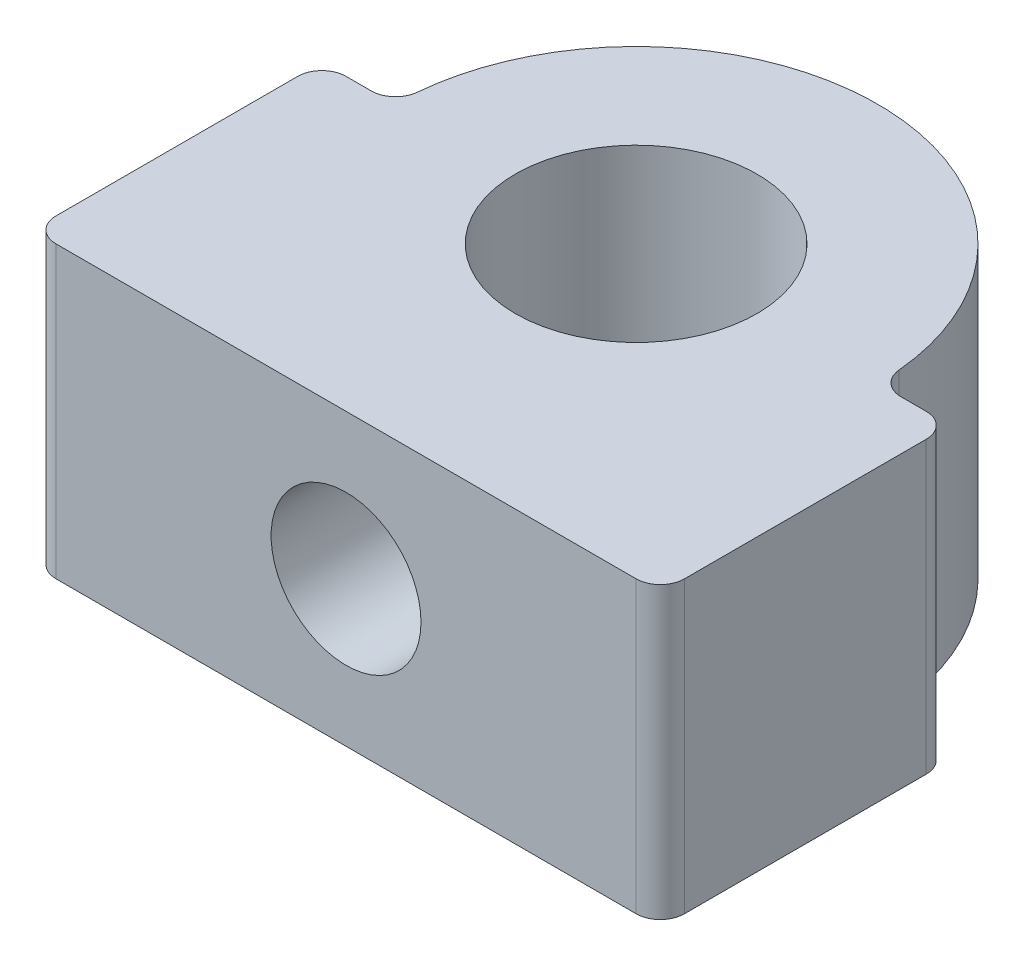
ISO-10303-21;
HEADER;
FILE_DESCRIPTION(('STEP AP214'),'2;1');
FILE_NAME('part.step','',(''),(''),'','','');
FILE_SCHEMA(('AUTOMOTIVE_DESIGN { 1 0 10303 214 1 1 1 1 }'));
ENDSEC;
DATA;
#1=APPLICATION_CONTEXT('core data for automotive mechanical design processes');
#2=APPLICATION_PROTOCOL_DEFINITION('international standard','automotive_design',2000,#1);
#3=PRODUCT_CONTEXT('',#1,'mechanical');
#4=PRODUCT('Part','Part','',(#3));
#5=PRODUCT_RELATED_PRODUCT_CATEGORY('part','',(#4));
#6=PRODUCT_DEFINITION_FORMATION('','',#4);
#7=PRODUCT_DEFINITION_CONTEXT('part definition',#1,'design');
#8=PRODUCT_DEFINITION('design','',#6,#7);
#9=PRODUCT_DEFINITION_SHAPE('','',#8);
#10=(LENGTH_UNIT() NAMED_UNIT(*) SI_UNIT(.MILLI.,.METRE.));
#11=(NAMED_UNIT(*) PLANE_ANGLE_UNIT() SI_UNIT($,.RADIAN.));
#12=(NAMED_UNIT(*) SI_UNIT($,.STERADIAN.) SOLID_ANGLE_UNIT());
#13=UNCERTAINTY_MEASURE_WITH_UNIT(LENGTH_MEASURE(1.E-05),#10,'distance_accuracy_value','');
#14=(GEOMETRIC_REPRESENTATION_CONTEXT(3) GLOBAL_UNCERTAINTY_ASSIGNED_CONTEXT((#13)) GLOBAL_UNIT_ASSIGNED_CONTEXT((#10,
#11,#12)) REPRESENTATION_CONTEXT('',''));
#15=CARTESIAN_POINT('',(0.,0.,0.));
#16=DIRECTION('',(0.,0.,1.));
#17=DIRECTION('',(1.,0.,0.));
#18=AXIS2_PLACEMENT_3D('',#15,#16,#17);
#19=CARTESIAN_POINT('',(-6.,6.,5.5));
#20=DIRECTION('',(0.,-1.,0.));
#21=DIRECTION('',(0.,0.,-1.));
#22=AXIS2_PLACEMENT_3D('',#19,#20,#21);
#23=CYLINDRICAL_SURFACE('',#22,0.5);
#24=CARTESIAN_POINT('',(-6.,0.,5.5));
#25=DIRECTION('',(0.,1.,0.));
#26=DIRECTION('',(0.,0.,1.));
#27=AXIS2_PLACEMENT_3D('',#24,#25,#26);
#28=CIRCLE('',#27,0.5);
#29=CARTESIAN_POINT('',(-6.5,0.,5.5));
#30=VERTEX_POINT('',#29);
#31=CARTESIAN_POINT('',(-6.,0.,6.));
#32=VERTEX_POINT('',#31);
#33=EDGE_CURVE('E159',#30,#32,#28,.T.);
#34=ORIENTED_EDGE('',*,*,#33,.T.);
#35=DIRECTION('',(0.,-1.,0.));
#36=VECTOR('',#35,1.);
#37=CARTESIAN_POINT('',(-6.,6.,6.));
#38=LINE('',#37,#36);
#39=CARTESIAN_POINT('',(-6.,6.,6.));
#40=VERTEX_POINT('',#39);
#41=EDGE_CURVE('E11',#40,#32,#38,.T.);
#42=ORIENTED_EDGE('',*,*,#41,.F.);
#43=CARTESIAN_POINT('',(-6.,6.,5.5));
#44=DIRECTION('',(0.,1.,0.));
#45=DIRECTION('',(0.,0.,1.));
#46=AXIS2_PLACEMENT_3D('',#43,#44,#45);
#47=CIRCLE('',#46,0.5);
#48=CARTESIAN_POINT('',(-6.5,6.,5.5));
#49=VERTEX_POINT('',#48);
#50=EDGE_CURVE('E182',#49,#40,#47,.T.);
#51=ORIENTED_EDGE('',*,*,#50,.F.);
#52=DIRECTION('',(0.,-1.,0.));
#53=VECTOR('',#52,1.);
#54=CARTESIAN_POINT('',(-6.5,6.,5.5));
#55=LINE('',#54,#53);
#56=EDGE_CURVE('E155',#49,#30,#55,.T.);
#57=ORIENTED_EDGE('',*,*,#56,.T.);
#58=EDGE_LOOP('',(#34,#42,#51,#57));
#59=FACE_BOUND('',#58,.T.);
#60=ADVANCED_FACE('F34',(#59),#23,.T.);
#61=CARTESIAN_POINT('',(5.,6.,6.));
#62=DIRECTION('',(0.,0.,-1.));
#63=DIRECTION('',(-1.,0.,0.));
#64=AXIS2_PLACEMENT_3D('',#61,#62,#63);
#65=PLANE('',#64);
#66=CARTESIAN_POINT('',(0.,3.,6.));
#67=DIRECTION('',(0.,0.,1.));
#68=DIRECTION('',(1.,0.,0.));
#69=AXIS2_PLACEMENT_3D('',#66,#67,#68);
#70=CIRCLE('',#69,1.55);
#71=CARTESIAN_POINT('',(1.55,3.,6.));
#72=VERTEX_POINT('',#71);
#73=EDGE_CURVE('E163',#72,#72,#70,.T.);
#74=ORIENTED_EDGE('',*,*,#73,.F.);
#75=EDGE_LOOP('',(#74));
#76=FACE_BOUND('',#75,.T.);
#77=DIRECTION('',(1.,0.,0.));
#78=VECTOR('',#77,1.);
#79=CARTESIAN_POINT('',(5.,0.,6.));
#80=LINE('',#79,#78);
#81=CARTESIAN_POINT('',(6.,0.,6.));
#82=VERTEX_POINT('',#81);
#83=EDGE_CURVE('E162',#32,#82,#80,.T.);
#84=ORIENTED_EDGE('',*,*,#83,.T.);
#85=DIRECTION('',(0.,-1.,0.));
#86=VECTOR('',#85,1.);
#87=CARTESIAN_POINT('',(6.,6.,6.));
#88=LINE('',#87,#86);
#89=CARTESIAN_POINT('',(6.,6.,6.));
#90=VERTEX_POINT('',#89);
#91=EDGE_CURVE('E47',#90,#82,#88,.T.);
#92=ORIENTED_EDGE('',*,*,#91,.F.);
#93=DIRECTION('',(1.,0.,0.));
#94=VECTOR('',#93,1.);
#95=CARTESIAN_POINT('',(-6.,6.,6.));
#96=LINE('',#95,#94);
#97=EDGE_CURVE('E110',#40,#90,#96,.T.);
#98=ORIENTED_EDGE('',*,*,#97,.F.);
#99=ORIENTED_EDGE('',*,*,#41,.T.);
#100=EDGE_LOOP('',(#84,#92,#98,#99));
#101=FACE_BOUND('',#100,.T.);
#102=ADVANCED_FACE('F262',(#76,#101),#65,.F.);
#103=CARTESIAN_POINT('',(6.,6.,5.5));
#104=DIRECTION('',(0.,-1.,0.));
#105=DIRECTION('',(0.,0.,-1.));
#106=AXIS2_PLACEMENT_3D('',#103,#104,#105);
#107=CYLINDRICAL_SURFACE('',#106,0.5);
#108=CARTESIAN_POINT('',(6.,0.,5.5));
#109=DIRECTION('',(0.,1.,0.));
#110=DIRECTION('',(0.,0.,1.));
#111=AXIS2_PLACEMENT_3D('',#108,#109,#110);
#112=CIRCLE('',#111,0.5);
#113=CARTESIAN_POINT('',(6.5,0.,5.5));
#114=VERTEX_POINT('',#113);
#115=EDGE_CURVE('E165',#82,#114,#112,.T.);
#116=ORIENTED_EDGE('',*,*,#115,.T.);
#117=DIRECTION('',(0.,-1.,0.));
#118=VECTOR('',#117,1.);
#119=CARTESIAN_POINT('',(6.5,6.,5.5));
#120=LINE('',#119,#118);
#121=CARTESIAN_POINT('',(6.5,6.,5.5));
#122=VERTEX_POINT('',#121);
#123=EDGE_CURVE('E201',#122,#114,#120,.T.);
#124=ORIENTED_EDGE('',*,*,#123,.F.);
#125=CARTESIAN_POINT('',(6.,6.,5.5));
#126=DIRECTION('',(0.,1.,0.));
#127=DIRECTION('',(0.,0.,1.));
#128=AXIS2_PLACEMENT_3D('',#125,#126,#127);
#129=CIRCLE('',#128,0.5);
#130=EDGE_CURVE('E210',#90,#122,#129,.T.);
#131=ORIENTED_EDGE('',*,*,#130,.F.);
#132=ORIENTED_EDGE('',*,*,#91,.T.);
#133=EDGE_LOOP('',(#116,#124,#131,#132));
#134=FACE_BOUND('',#133,.T.);
#135=ADVANCED_FACE('F208',(#134),#107,.T.);
#136=CARTESIAN_POINT('',(6.5,6.,5.5));
#137=DIRECTION('',(-1.,0.,0.));
#138=DIRECTION('',(0.,0.,1.));
#139=AXIS2_PLACEMENT_3D('',#136,#137,#138);
#140=PLANE('',#139);
#141=DIRECTION('',(0.,0.,-1.));
#142=VECTOR('',#141,1.);
#143=CARTESIAN_POINT('',(6.5,0.,5.5));
#144=LINE('',#143,#142);
#145=CARTESIAN_POINT('',(6.5,0.,0.500000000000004));
#146=VERTEX_POINT('',#145);
#147=EDGE_CURVE('E167',#114,#146,#144,.T.);
#148=ORIENTED_EDGE('',*,*,#147,.T.);
#149=DIRECTION('',(0.,-1.,0.));
#150=VECTOR('',#149,1.);
#151=CARTESIAN_POINT('',(6.5,6.,0.500000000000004));
#152=LINE('',#151,#150);
#153=CARTESIAN_POINT('',(6.5,6.,0.500000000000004));
#154=VERTEX_POINT('',#153);
#155=EDGE_CURVE('E198',#154,#146,#152,.T.);
#156=ORIENTED_EDGE('',*,*,#155,.F.);
#157=DIRECTION('',(0.,0.,-1.));
#158=VECTOR('',#157,1.);
#159=CARTESIAN_POINT('',(6.5,6.,5.5));
#160=LINE('',#159,#158);
#161=EDGE_CURVE('E228',#122,#154,#160,.T.);
#162=ORIENTED_EDGE('',*,*,#161,.F.);
#163=ORIENTED_EDGE('',*,*,#123,.T.);
#164=EDGE_LOOP('',(#148,#156,#162,#163));
#165=FACE_BOUND('',#164,.T.);
#166=ADVANCED_FACE('F219',(#165),#140,.F.);
#167=CARTESIAN_POINT('',(6.,6.,0.5));
#168=DIRECTION('',(0.,-1.,0.));
#169=DIRECTION('',(0.,0.,-1.));
#170=AXIS2_PLACEMENT_3D('',#167,#168,#169);
#171=CYLINDRICAL_SURFACE('',#170,0.5);
#172=CARTESIAN_POINT('',(6.,0.,0.5));
#173=DIRECTION('',(0.,1.,0.));
#174=DIRECTION('',(0.,0.,1.));
#175=AXIS2_PLACEMENT_3D('',#172,#173,#174);
#176=CIRCLE('',#175,0.5);
#177=CARTESIAN_POINT('',(6.,0.,0.));
#178=VERTEX_POINT('',#177);
#179=EDGE_CURVE('E169',#146,#178,#176,.T.);
#180=ORIENTED_EDGE('',*,*,#179,.T.);
#181=DIRECTION('',(0.,-1.,0.));
#182=VECTOR('',#181,1.);
#183=CARTESIAN_POINT('',(6.,6.,0.));
#184=LINE('',#183,#182);
#185=CARTESIAN_POINT('',(6.,6.,0.));
#186=VERTEX_POINT('',#185);
#187=EDGE_CURVE('E195',#186,#178,#184,.T.);
#188=ORIENTED_EDGE('',*,*,#187,.F.);
#189=CARTESIAN_POINT('',(6.,6.,0.5));
#190=DIRECTION('',(0.,1.,0.));
#191=DIRECTION('',(0.,0.,1.));
#192=AXIS2_PLACEMENT_3D('',#189,#190,#191);
#193=CIRCLE('',#192,0.5);
#194=EDGE_CURVE('E225',#154,#186,#193,.T.);
#195=ORIENTED_EDGE('',*,*,#194,.F.);
#196=ORIENTED_EDGE('',*,*,#155,.T.);
#197=EDGE_LOOP('',(#180,#188,#195,#196));
#198=FACE_BOUND('',#197,.T.);
#199=ADVANCED_FACE('F223',(#198),#171,.T.);
#200=CARTESIAN_POINT('',(6.,6.,0.));
#201=DIRECTION('',(0.,0.,1.));
#202=DIRECTION('',(1.,0.,0.));
#203=AXIS2_PLACEMENT_3D('',#200,#201,#202);
#204=PLANE('',#203);
#205=DIRECTION('',(-1.,0.,0.));
#206=VECTOR('',#205,1.);
#207=CARTESIAN_POINT('',(6.,0.,0.));
#208=LINE('',#207,#206);
#209=CARTESIAN_POINT('',(5.47722557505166,0.,0.));
#210=VERTEX_POINT('',#209);
#211=EDGE_CURVE('E171',#178,#210,#208,.T.);
#212=ORIENTED_EDGE('',*,*,#211,.T.);
#213=DIRECTION('',(0.,-1.,0.));
#214=VECTOR('',#213,1.);
#215=CARTESIAN_POINT('',(5.47722557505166,6.,0.));
#216=LINE('',#215,#214);
#217=CARTESIAN_POINT('',(5.47722557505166,6.,0.));
#218=VERTEX_POINT('',#217);
#219=EDGE_CURVE('E192',#218,#210,#216,.T.);
#220=ORIENTED_EDGE('',*,*,#219,.F.);
#221=DIRECTION('',(-1.,0.,0.));
#222=VECTOR('',#221,1.);
#223=CARTESIAN_POINT('',(6.,6.,0.));
#224=LINE('',#223,#222);
#225=EDGE_CURVE('E227',#186,#218,#224,.T.);
#226=ORIENTED_EDGE('',*,*,#225,.F.);
#227=ORIENTED_EDGE('',*,*,#187,.T.);
#228=EDGE_LOOP('',(#212,#220,#226,#227));
#229=FACE_BOUND('',#228,.T.);
#230=ADVANCED_FACE('F277',(#229),#204,.F.);
#231=CARTESIAN_POINT('',(5.47722557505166,6.,-0.5));
#232=DIRECTION('',(0.,-1.,0.));
#233=DIRECTION('',(0.,0.,-1.));
#234=AXIS2_PLACEMENT_3D('',#231,#232,#233);
#235=CYLINDRICAL_SURFACE('',#234,0.5);
#236=CARTESIAN_POINT('',(5.47722557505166,0.,-0.5));
#237=DIRECTION('',(0.,-1.,0.));
#238=DIRECTION('',(0.,0.,-1.));
#239=AXIS2_PLACEMENT_3D('',#236,#237,#238);
#240=CIRCLE('',#239,0.5);
#241=CARTESIAN_POINT('',(4.97929597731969,0.,-0.454545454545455));
#242=VERTEX_POINT('',#241);
#243=EDGE_CURVE('E173',#210,#242,#240,.T.);
#244=ORIENTED_EDGE('',*,*,#243,.T.);
#245=DIRECTION('',(0.,-1.,0.));
#246=VECTOR('',#245,1.);
#247=CARTESIAN_POINT('',(4.97929597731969,6.,-0.454545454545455));
#248=LINE('',#247,#246);
#249=CARTESIAN_POINT('',(4.97929597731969,6.,-0.454545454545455));
#250=VERTEX_POINT('',#249);
#251=EDGE_CURVE('E189',#250,#242,#248,.T.);
#252=ORIENTED_EDGE('',*,*,#251,.F.);
#253=CARTESIAN_POINT('',(5.47722557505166,6.,-0.5));
#254=DIRECTION('',(0.,-1.,0.));
#255=DIRECTION('',(0.,0.,-1.));
#256=AXIS2_PLACEMENT_3D('',#253,#254,#255);
#257=CIRCLE('',#256,0.5);
#258=EDGE_CURVE('E230',#218,#250,#257,.T.);
#259=ORIENTED_EDGE('',*,*,#258,.F.);
#260=ORIENTED_EDGE('',*,*,#219,.T.);
#261=EDGE_LOOP('',(#244,#252,#259,#260));
#262=FACE_BOUND('',#261,.T.);
#263=ADVANCED_FACE('F280',(#262),#235,.F.);
#264=CARTESIAN_POINT('',(0.,6.,0.));
#265=DIRECTION('',(0.,-1.,0.));
#266=DIRECTION('',(0.,0.,-1.));
#267=AXIS2_PLACEMENT_3D('',#264,#265,#266);
#268=CYLINDRICAL_SURFACE('',#267,5.);
#269=CARTESIAN_POINT('',(0.,0.,0.));
#270=DIRECTION('',(0.,1.,0.));
#271=DIRECTION('',(0.,0.,1.));
#272=AXIS2_PLACEMENT_3D('',#269,#270,#271);
#273=CIRCLE('',#272,5.);
#274=CARTESIAN_POINT('',(-4.97929597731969,0.,-0.454545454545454));
#275=VERTEX_POINT('',#274);
#276=EDGE_CURVE('E175',#242,#275,#273,.T.);
#277=ORIENTED_EDGE('',*,*,#276,.T.);
#278=DIRECTION('',(0.,-1.,0.));
#279=VECTOR('',#278,1.);
#280=CARTESIAN_POINT('',(-4.97929597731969,6.,-0.454545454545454));
#281=LINE('',#280,#279);
#282=CARTESIAN_POINT('',(-4.97929597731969,6.,-0.454545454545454));
#283=VERTEX_POINT('',#282);
#284=EDGE_CURVE('E186',#283,#275,#281,.T.);
#285=ORIENTED_EDGE('',*,*,#284,.F.);
#286=CARTESIAN_POINT('',(0.,6.,0.));
#287=DIRECTION('',(0.,1.,0.));
#288=DIRECTION('',(0.,0.,1.));
#289=AXIS2_PLACEMENT_3D('',#286,#287,#288);
#290=CIRCLE('',#289,5.);
#291=EDGE_CURVE('E236',#250,#283,#290,.T.);
#292=ORIENTED_EDGE('',*,*,#291,.F.);
#293=ORIENTED_EDGE('',*,*,#251,.T.);
#294=EDGE_LOOP('',(#277,#285,#292,#293));
#295=FACE_BOUND('',#294,.T.);
#296=ADVANCED_FACE('F242',(#295),#268,.T.);
#297=CARTESIAN_POINT('',(-5.47722557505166,6.,-0.5));
#298=DIRECTION('',(0.,-1.,0.));
#299=DIRECTION('',(0.,0.,-1.));
#300=AXIS2_PLACEMENT_3D('',#297,#298,#299);
#301=CYLINDRICAL_SURFACE('',#300,0.5);
#302=CARTESIAN_POINT('',(-5.47722557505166,0.,-0.5));
#303=DIRECTION('',(0.,-1.,0.));
#304=DIRECTION('',(0.,0.,1.));
#305=AXIS2_PLACEMENT_3D('',#302,#303,#304);
#306=CIRCLE('',#305,0.5);
#307=CARTESIAN_POINT('',(-5.47722557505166,0.,0.));
#308=VERTEX_POINT('',#307);
#309=EDGE_CURVE('E177',#275,#308,#306,.T.);
#310=ORIENTED_EDGE('',*,*,#309,.T.);
#311=DIRECTION('',(0.,-1.,0.));
#312=VECTOR('',#311,1.);
#313=CARTESIAN_POINT('',(-5.47722557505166,6.,0.));
#314=LINE('',#313,#312);
#315=CARTESIAN_POINT('',(-5.47722557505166,6.,0.));
#316=VERTEX_POINT('',#315);
#317=EDGE_CURVE('E150',#316,#308,#314,.T.);
#318=ORIENTED_EDGE('',*,*,#317,.F.);
#319=CARTESIAN_POINT('',(-5.47722557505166,6.,-0.5));
#320=DIRECTION('',(0.,-1.,0.));
#321=DIRECTION('',(0.,0.,1.));
#322=AXIS2_PLACEMENT_3D('',#319,#320,#321);
#323=CIRCLE('',#322,0.5);
#324=EDGE_CURVE('E141',#283,#316,#323,.T.);
#325=ORIENTED_EDGE('',*,*,#324,.F.);
#326=ORIENTED_EDGE('',*,*,#284,.T.);
#327=EDGE_LOOP('',(#310,#318,#325,#326));
#328=FACE_BOUND('',#327,.T.);
#329=ADVANCED_FACE('F246',(#328),#301,.F.);
#330=CARTESIAN_POINT('',(-5.47722557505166,6.,0.));
#331=DIRECTION('',(0.,0.,1.));
#332=DIRECTION('',(1.,0.,0.));
#333=AXIS2_PLACEMENT_3D('',#330,#331,#332);
#334=PLANE('',#333);
#335=DIRECTION('',(-1.,0.,0.));
#336=VECTOR('',#335,1.);
#337=CARTESIAN_POINT('',(-5.47722557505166,0.,0.));
#338=LINE('',#337,#336);
#339=CARTESIAN_POINT('',(-6.,0.,0.));
#340=VERTEX_POINT('',#339);
#341=EDGE_CURVE('E149',#308,#340,#338,.T.);
#342=ORIENTED_EDGE('',*,*,#341,.T.);
#343=DIRECTION('',(0.,-1.,0.));
#344=VECTOR('',#343,1.);
#345=CARTESIAN_POINT('',(-6.,6.,0.));
#346=LINE('',#345,#344);
#347=CARTESIAN_POINT('',(-6.,6.,0.));
#348=VERTEX_POINT('',#347);
#349=EDGE_CURVE('E146',#348,#340,#346,.T.);
#350=ORIENTED_EDGE('',*,*,#349,.F.);
#351=DIRECTION('',(-1.,0.,0.));
#352=VECTOR('',#351,1.);
#353=CARTESIAN_POINT('',(-5.47722557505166,6.,0.));
#354=LINE('',#353,#352);
#355=EDGE_CURVE('E135',#316,#348,#354,.T.);
#356=ORIENTED_EDGE('',*,*,#355,.F.);
#357=ORIENTED_EDGE('',*,*,#317,.T.);
#358=EDGE_LOOP('',(#342,#350,#356,#357));
#359=FACE_BOUND('',#358,.T.);
#360=ADVANCED_FACE('F147',(#359),#334,.F.);
#361=CARTESIAN_POINT('',(-6.,6.,0.5));
#362=DIRECTION('',(0.,-1.,0.));
#363=DIRECTION('',(0.,0.,-1.));
#364=AXIS2_PLACEMENT_3D('',#361,#362,#363);
#365=CYLINDRICAL_SURFACE('',#364,0.5);
#366=CARTESIAN_POINT('',(-6.,0.,0.5));
#367=DIRECTION('',(0.,1.,0.));
#368=DIRECTION('',(0.,0.,1.));
#369=AXIS2_PLACEMENT_3D('',#366,#367,#368);
#370=CIRCLE('',#369,0.5);
#371=CARTESIAN_POINT('',(-6.5,0.,0.500000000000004));
#372=VERTEX_POINT('',#371);
#373=EDGE_CURVE('E96',#340,#372,#370,.T.);
#374=ORIENTED_EDGE('',*,*,#373,.T.);
#375=DIRECTION('',(0.,-1.,0.));
#376=VECTOR('',#375,1.);
#377=CARTESIAN_POINT('',(-6.5,6.,0.500000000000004));
#378=LINE('',#377,#376);
#379=CARTESIAN_POINT('',(-6.5,6.,0.500000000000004));
#380=VERTEX_POINT('',#379);
#381=EDGE_CURVE('E151',#380,#372,#378,.T.);
#382=ORIENTED_EDGE('',*,*,#381,.F.);
#383=CARTESIAN_POINT('',(-6.,6.,0.5));
#384=DIRECTION('',(0.,1.,0.));
#385=DIRECTION('',(0.,0.,1.));
#386=AXIS2_PLACEMENT_3D('',#383,#384,#385);
#387=CIRCLE('',#386,0.5);
#388=EDGE_CURVE('E139',#348,#380,#387,.T.);
#389=ORIENTED_EDGE('',*,*,#388,.F.);
#390=ORIENTED_EDGE('',*,*,#349,.T.);
#391=EDGE_LOOP('',(#374,#382,#389,#390));
#392=FACE_BOUND('',#391,.T.);
#393=ADVANCED_FACE('F153',(#392),#365,.T.);
#394=CARTESIAN_POINT('',(-6.5,6.,0.500000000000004));
#395=DIRECTION('',(1.,0.,0.));
#396=DIRECTION('',(0.,0.,-1.));
#397=AXIS2_PLACEMENT_3D('',#394,#395,#396);
#398=PLANE('',#397);
#399=DIRECTION('',(0.,0.,1.));
#400=VECTOR('',#399,1.);
#401=CARTESIAN_POINT('',(-6.5,0.,0.500000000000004));
#402=LINE('',#401,#400);
#403=EDGE_CURVE('E102',#372,#30,#402,.T.);
#404=ORIENTED_EDGE('',*,*,#403,.T.);
#405=ORIENTED_EDGE('',*,*,#56,.F.);
#406=DIRECTION('',(0.,0.,1.));
#407=VECTOR('',#406,1.);
#408=CARTESIAN_POINT('',(-6.5,6.,0.500000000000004));
#409=LINE('',#408,#407);
#410=EDGE_CURVE('E55',#380,#49,#409,.T.);
#411=ORIENTED_EDGE('',*,*,#410,.F.);
#412=ORIENTED_EDGE('',*,*,#381,.T.);
#413=EDGE_LOOP('',(#404,#405,#411,#412));
#414=FACE_BOUND('',#413,.T.);
#415=ADVANCED_FACE('F250',(#414),#398,.F.);
#416=CARTESIAN_POINT('',(-6.,6.,5.5));
#417=DIRECTION('',(0.,1.,0.));
#418=DIRECTION('',(0.,0.,1.));
#419=AXIS2_PLACEMENT_3D('',#416,#417,#418);
#420=PLANE('',#419);
#421=CARTESIAN_POINT('',(0.,6.,0.));
#422=DIRECTION('',(0.,1.,0.));
#423=DIRECTION('',(0.,0.,1.));
#424=AXIS2_PLACEMENT_3D('',#421,#422,#423);
#425=CIRCLE('',#424,2.5);
#426=CARTESIAN_POINT('',(0.,6.,2.5));
#427=VERTEX_POINT('',#426);
#428=EDGE_CURVE('E353',#427,#427,#425,.T.);
#429=ORIENTED_EDGE('',*,*,#428,.F.);
#430=EDGE_LOOP('',(#429));
#431=FACE_BOUND('',#430,.T.);
#432=ORIENTED_EDGE('',*,*,#50,.T.);
#433=ORIENTED_EDGE('',*,*,#97,.T.);
#434=ORIENTED_EDGE('',*,*,#130,.T.);
#435=ORIENTED_EDGE('',*,*,#161,.T.);
#436=ORIENTED_EDGE('',*,*,#194,.T.);
#437=ORIENTED_EDGE('',*,*,#225,.T.);
#438=ORIENTED_EDGE('',*,*,#258,.T.);
#439=ORIENTED_EDGE('',*,*,#291,.T.);
#440=ORIENTED_EDGE('',*,*,#324,.T.);
#441=ORIENTED_EDGE('',*,*,#355,.T.);
#442=ORIENTED_EDGE('',*,*,#388,.T.);
#443=ORIENTED_EDGE('',*,*,#410,.T.);
#444=EDGE_LOOP('',(#432,#433,#434,#435,#436,#437,#438,#439,#440,#441,#442,#443));
#445=FACE_BOUND('',#444,.T.);
#446=ADVANCED_FACE('F137',(#431,#445),#420,.T.);
#447=CARTESIAN_POINT('',(-6.,0.,5.5));
#448=DIRECTION('',(0.,1.,0.));
#449=DIRECTION('',(0.,0.,1.));
#450=AXIS2_PLACEMENT_3D('',#447,#448,#449);
#451=PLANE('',#450);
#452=CARTESIAN_POINT('',(0.,0.,0.));
#453=DIRECTION('',(0.,1.,0.));
#454=DIRECTION('',(0.,0.,1.));
#455=AXIS2_PLACEMENT_3D('',#452,#453,#454);
#456=CIRCLE('',#455,2.5);
#457=CARTESIAN_POINT('',(0.,0.,2.5));
#458=VERTEX_POINT('',#457);
#459=EDGE_CURVE('E357',#458,#458,#456,.T.);
#460=ORIENTED_EDGE('',*,*,#459,.T.);
#461=EDGE_LOOP('',(#460));
#462=FACE_BOUND('',#461,.T.);
#463=ORIENTED_EDGE('',*,*,#33,.F.);
#464=ORIENTED_EDGE('',*,*,#403,.F.);
#465=ORIENTED_EDGE('',*,*,#373,.F.);
#466=ORIENTED_EDGE('',*,*,#341,.F.);
#467=ORIENTED_EDGE('',*,*,#309,.F.);
#468=ORIENTED_EDGE('',*,*,#276,.F.);
#469=ORIENTED_EDGE('',*,*,#243,.F.);
#470=ORIENTED_EDGE('',*,*,#211,.F.);
#471=ORIENTED_EDGE('',*,*,#179,.F.);
#472=ORIENTED_EDGE('',*,*,#147,.F.);
#473=ORIENTED_EDGE('',*,*,#115,.F.);
#474=ORIENTED_EDGE('',*,*,#83,.F.);
#475=EDGE_LOOP('',(#463,#464,#465,#466,#467,#468,#469,#470,#471,#472,#473,#474));
#476=FACE_BOUND('',#475,.T.);
#477=ADVANCED_FACE('F214',(#462,#476),#451,.F.);
#478=CARTESIAN_POINT('',(0.,3.,1.));
#479=DIRECTION('',(0.,0.,1.));
#480=DIRECTION('',(1.,0.,0.));
#481=AXIS2_PLACEMENT_3D('',#478,#479,#480);
#482=CYLINDRICAL_SURFACE('',#481,1.55);
#483=CARTESIAN_POINT('',(1.55,3.,1.9615045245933));
#484=CARTESIAN_POINT('',(1.5499937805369,2.9228113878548,1.96151424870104));
#485=CARTESIAN_POINT('',(1.54418156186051,2.84549539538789,1.96614557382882));
#486=CARTESIAN_POINT('',(1.52134108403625,2.6934502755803,1.9838633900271));
#487=CARTESIAN_POINT('',(1.50428128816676,2.61872904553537,1.99697365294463));
#488=CARTESIAN_POINT('',(1.46014635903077,2.47453556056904,2.0294601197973));
#489=CARTESIAN_POINT('',(1.4331568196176,2.40502438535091,2.04878260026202));
#490=CARTESIAN_POINT('',(1.37017871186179,2.27160495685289,2.0914239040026));
#491=CARTESIAN_POINT('',(1.33419016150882,2.20769669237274,2.11474271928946));
#492=CARTESIAN_POINT('',(1.24870950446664,2.07803338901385,2.16645646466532));
#493=CARTESIAN_POINT('',(1.1980629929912,2.01314437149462,2.19511540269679));
#494=CARTESIAN_POINT('',(1.08706120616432,1.89205076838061,2.25215425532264));
#495=CARTESIAN_POINT('',(1.02669764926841,1.83585367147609,2.28053390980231));
#496=CARTESIAN_POINT('',(0.889350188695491,1.72716984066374,2.33778046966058));
#497=CARTESIAN_POINT('',(0.81124555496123,1.67590364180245,2.36630963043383));
#498=CARTESIAN_POINT('',(0.645413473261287,1.58764893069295,2.41680070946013));
#499=CARTESIAN_POINT('',(0.55769553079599,1.5506464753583,2.43876903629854));
#500=CARTESIAN_POINT('',(0.384422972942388,1.49596476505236,2.47167893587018));
#501=CARTESIAN_POINT('',(0.299535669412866,1.47671822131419,2.48350627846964));
#502=CARTESIAN_POINT('',(0.127003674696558,1.45276647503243,2.49826692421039));
#503=CARTESIAN_POINT('',(0.0393619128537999,1.44804631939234,2.50120937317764));
#504=CARTESIAN_POINT('',(-0.12367898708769,1.45307979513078,2.49809230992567));
#505=CARTESIAN_POINT('',(-0.199165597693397,1.46100333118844,2.49317090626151));
#506=CARTESIAN_POINT('',(-0.34749235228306,1.48757649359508,2.47685576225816));
#507=CARTESIAN_POINT('',(-0.420332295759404,1.50622693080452,2.46546153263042));
#508=CARTESIAN_POINT('',(-0.561802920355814,1.55346517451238,2.43713069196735));
#509=CARTESIAN_POINT('',(-0.630419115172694,1.58208515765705,2.42017614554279));
#510=CARTESIAN_POINT('',(-0.761935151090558,1.64819471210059,2.38204725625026));
#511=CARTESIAN_POINT('',(-0.824833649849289,1.6856863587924,2.36087192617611));
#512=CARTESIAN_POINT('',(-0.951461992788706,1.77367303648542,2.31297395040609));
#513=CARTESIAN_POINT('',(-1.01433525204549,1.82520213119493,2.28588918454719));
#514=CARTESIAN_POINT('',(-1.13109037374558,1.93713191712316,2.23043110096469));
#515=CARTESIAN_POINT('',(-1.18495908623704,1.99754534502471,2.2020559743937));
#516=CARTESIAN_POINT('',(-1.28915668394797,2.13460587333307,2.1429182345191));
#517=CARTESIAN_POINT('',(-1.33815632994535,2.21234077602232,2.11231310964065));
#518=CARTESIAN_POINT('',(-1.42219070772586,2.37681396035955,2.05667767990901));
#519=CARTESIAN_POINT('',(-1.45725123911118,2.46353523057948,2.03163711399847));
#520=CARTESIAN_POINT('',(-1.50444702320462,2.62052638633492,1.99681385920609));
#521=CARTESIAN_POINT('',(-1.52017298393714,2.68920988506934,1.98475675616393));
#522=CARTESIAN_POINT('',(-1.54214392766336,2.82890302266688,1.96773803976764));
#523=CARTESIAN_POINT('',(-1.54840146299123,2.89990945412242,1.96276703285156));
#524=CARTESIAN_POINT('',(-1.55106122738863,3.04237526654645,1.96066654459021));
#525=CARTESIAN_POINT('',(-1.54744283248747,3.11383528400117,1.96355347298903));
#526=CARTESIAN_POINT('',(-1.53054655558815,3.25492119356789,1.97674871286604));
#527=CARTESIAN_POINT('',(-1.51726072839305,3.32454552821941,1.98706312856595));
#528=CARTESIAN_POINT('',(-1.48199694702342,3.45932567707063,2.01349354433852));
#529=CARTESIAN_POINT('',(-1.46013594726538,3.52452831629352,2.02953123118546));
#530=CARTESIAN_POINT('',(-1.40853800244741,3.65050775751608,2.06567447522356));
#531=CARTESIAN_POINT('',(-1.37879823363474,3.7112829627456,2.08578149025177));
#532=CARTESIAN_POINT('',(-1.30583485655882,3.83884793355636,2.1323696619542));
#533=CARTESIAN_POINT('',(-1.26112609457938,3.90461069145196,2.15933780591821));
#534=CARTESIAN_POINT('',(-1.16238388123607,4.02841786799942,2.21405897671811));
#535=CARTESIAN_POINT('',(-1.10834087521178,4.0864542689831,2.24181278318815));
#536=CARTESIAN_POINT('',(-0.982598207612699,4.20224001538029,2.30000071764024));
#537=CARTESIAN_POINT('',(-0.909461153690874,4.25856963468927,2.3301896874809));
#538=CARTESIAN_POINT('',(-0.752912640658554,4.35801466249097,2.38537108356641));
#539=CARTESIAN_POINT('',(-0.66950649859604,4.4011368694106,2.41036618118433));
#540=CARTESIAN_POINT('',(-0.499957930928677,4.46981922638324,2.45094902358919));
#541=CARTESIAN_POINT('',(-0.414316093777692,4.49631203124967,2.46702888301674));
#542=CARTESIAN_POINT('',(-0.238607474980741,4.53414847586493,2.49015690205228));
#543=CARTESIAN_POINT('',(-0.148546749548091,4.5455122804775,2.49721708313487));
#544=CARTESIAN_POINT('',(0.0192407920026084,4.55181670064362,2.50112707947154));
#545=CARTESIAN_POINT('',(0.096865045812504,4.54889732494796,2.49930744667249));
#546=CARTESIAN_POINT('',(0.250321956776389,4.53159958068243,2.48862410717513));
#547=CARTESIAN_POINT('',(0.326154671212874,4.51722157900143,2.47976062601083));
#548=CARTESIAN_POINT('',(0.471629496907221,4.47836608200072,2.45618356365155));
#549=CARTESIAN_POINT('',(0.541390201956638,4.45421229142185,2.44165799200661));
#550=CARTESIAN_POINT('',(0.675823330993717,4.39682106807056,2.40791840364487));
#551=CARTESIAN_POINT('',(0.740494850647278,4.36358202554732,2.38870355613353));
#552=CARTESIAN_POINT('',(0.87026927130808,4.28509626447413,2.34473975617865));
#553=CARTESIAN_POINT('',(0.93470415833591,4.23895508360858,2.31962153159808));
#554=CARTESIAN_POINT('',(1.05539147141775,4.13791668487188,2.26726405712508));
#555=CARTESIAN_POINT('',(1.11163441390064,4.08300947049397,2.24002240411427));
#556=CARTESIAN_POINT('',(1.22253718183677,3.95703133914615,2.18170907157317));
#557=CARTESIAN_POINT('',(1.27585613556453,3.8847729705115,2.15063883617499));
#558=CARTESIAN_POINT('',(1.36973708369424,3.73103535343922,2.09210043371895));
#559=CARTESIAN_POINT('',(1.41030697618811,3.64956185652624,2.06463004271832));
#560=CARTESIAN_POINT('',(1.46964948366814,3.49772207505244,2.02265873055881));
#561=CARTESIAN_POINT('',(1.49125879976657,3.4288866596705,2.00663302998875));
#562=CARTESIAN_POINT('',(1.5247571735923,3.28780564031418,1.98130472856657));
#563=CARTESIAN_POINT('',(1.53667749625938,3.2155718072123,1.97198051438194));
#564=CARTESIAN_POINT('',(1.5456103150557,3.11898758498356,1.96496636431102));
#565=CARTESIAN_POINT('',(1.54725399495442,3.09524421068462,1.963671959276));
#566=CARTESIAN_POINT('',(1.54944992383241,3.04767128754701,1.96193943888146));
#567=CARTESIAN_POINT('',(1.55000192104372,3.0238417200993,1.9615015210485));
#568=CARTESIAN_POINT('',(1.55,3.,1.9615045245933));
#569=B_SPLINE_CURVE_WITH_KNOTS('',3,(#483,#484,#485,#486,#487,#488,#489,#490,#491,#492,#493,
#494,#495,#496,#497,#498,#499,#500,#501,#502,#503,#504,#505,#506,#507,#508,#509,#510,#511,#512,
#513,#514,#515,#516,#517,#518,#519,#520,#521,#522,#523,#524,#525,#526,#527,#528,#529,#530,#531,
#532,#533,#534,#535,#536,#537,#538,#539,#540,#541,#542,#543,#544,#545,#546,#547,#548,#549,#550,
#551,#552,#553,#554,#555,#556,#557,#558,#559,#560,#561,#562,#563,#564,#565,#566,#567,#568),
.UNSPECIFIED.,.T.,.F.,(4,2,2,2,2,2,2,2,2,2,2,2,2,2,2,2,2,2,2,2,2,2,2,2,2,2,2,2,2,2,2,2,2,2,2,2,
2,2,2,2,2,2,4),(0.,0.231456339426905,0.463564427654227,0.693716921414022,0.923868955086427,
1.18434367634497,1.44504157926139,1.7365052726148,2.02768332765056,2.28962147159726,
2.55128989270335,2.77838248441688,3.00549224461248,3.23334189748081,3.46124490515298,
3.71729257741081,3.97371096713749,4.26285545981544,4.55146226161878,4.76501730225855,
4.97828898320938,5.19200638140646,5.40589962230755,5.61697175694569,5.82811964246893,
6.0790848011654,6.33030839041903,6.62020835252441,6.9099588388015,7.18151717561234,
7.45271319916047,7.68463598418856,7.91655134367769,8.14134480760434,8.36617812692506,
8.61462416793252,8.8633555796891,9.14715079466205,9.4307698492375,9.65163722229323,
9.87178902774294,9.94326388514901,10.0147552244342),.UNSPECIFIED.);
#570=CARTESIAN_POINT('',(1.55,3.,1.9615045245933));
#571=VERTEX_POINT('',#570);
#572=EDGE_CURVE('E37',#571,#571,#569,.T.);
#573=ORIENTED_EDGE('',*,*,#572,.T.);
#574=EDGE_LOOP('',(#573));
#575=FACE_BOUND('',#574,.T.);
#576=ORIENTED_EDGE('',*,*,#73,.T.);
#577=EDGE_LOOP('',(#576));
#578=FACE_BOUND('',#577,.T.);
#579=ADVANCED_FACE('F323',(#575,#578),#482,.F.);
#580=CARTESIAN_POINT('',(0.,0.,0.));
#581=DIRECTION('',(0.,1.,0.));
#582=DIRECTION('',(0.,0.,1.));
#583=AXIS2_PLACEMENT_3D('',#580,#581,#582);
#584=CYLINDRICAL_SURFACE('',#583,2.5);
#585=ORIENTED_EDGE('',*,*,#428,.T.);
#586=EDGE_LOOP('',(#585));
#587=FACE_BOUND('',#586,.T.);
#588=ORIENTED_EDGE('',*,*,#459,.F.);
#589=EDGE_LOOP('',(#588));
#590=FACE_BOUND('',#589,.T.);
#591=ORIENTED_EDGE('',*,*,#572,.F.);
#592=EDGE_LOOP('',(#591));
#593=FACE_BOUND('',#592,.T.);
#594=ADVANCED_FACE('F333',(#587,#590,#593),#584,.F.);
#595=CLOSED_SHELL('',(#60,#102,#135,#166,#199,#230,#263,#296,#329,#360,#393,#415,#446,#477,#579,#594));
#596=MANIFOLD_SOLID_BREP('B2',#595);
#597=ADVANCED_BREP_SHAPE_REPRESENTATION('',(#18,#596),#14);
#598=SHAPE_DEFINITION_REPRESENTATION(#9,#597);
ENDSEC;
END-ISO-10303-21;
